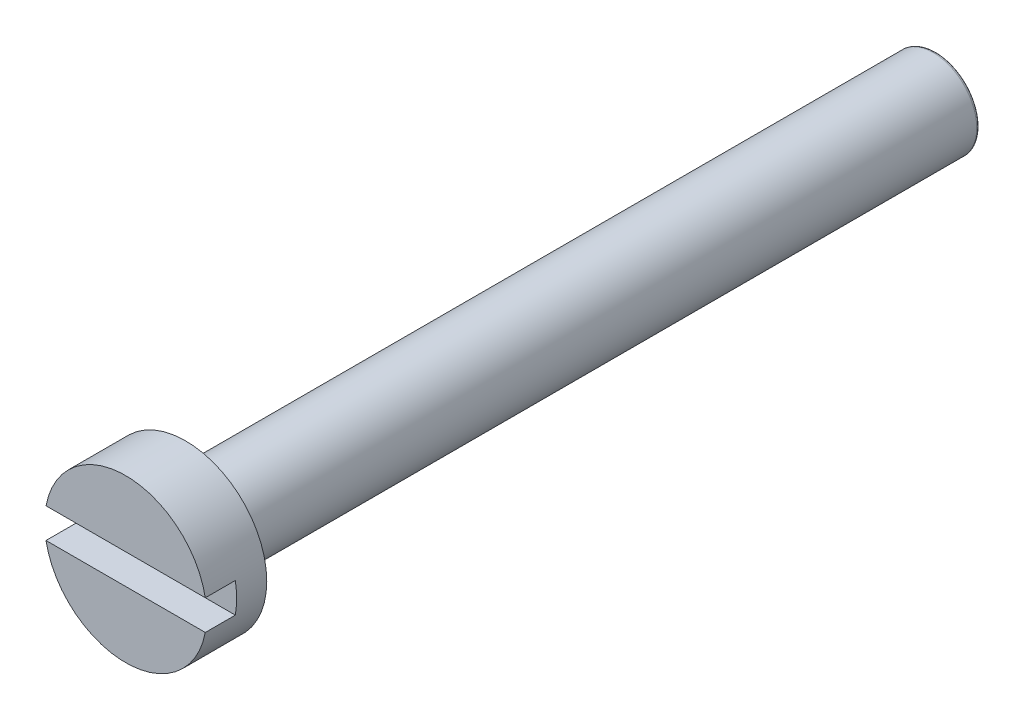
from build123d import *

# Parameters (mm, degrees)
ESQUISSE1_R             = 2.7
EXTRUSION1_DEPTH        = 2
ESQUISSE2_W             = 20
ESQUISSE2_H             = 1
ENL_V_MAT_EXTRU_1_DEPTH = 1
ESQUISSE3_R             = 1.45
EXTRUSION2_DEPTH        = 25
CONG_1_R                = 0.1


with BuildPart() as part:
    # Esquisse1 → Extrusion1 (new body)
    with BuildSketch(Plane.XY):
        Circle(ESQUISSE1_R)
    extrude(amount=EXTRUSION1_DEPTH)

    # Esquisse2 → Enl_v. mat.-Extru.1 (cut)
    with BuildSketch(Plane.XY.offset(2)):
        Rectangle(ESQUISSE2_W, ESQUISSE2_H)
    extrude(amount=-ENL_V_MAT_EXTRU_1_DEPTH, mode=Mode.SUBTRACT)

    # Esquisse3 → Extrusion2 (add)
    with BuildSketch(Plane(origin=(0, 0, 0), x_dir=(-1, 0, 0), z_dir=(0, 0, -1))):
        with Locations(Location((0, 0, 0), (0, 0, 180))):
            Circle(ESQUISSE3_R)
    extrude(amount=EXTRUSION2_DEPTH)

    # Cong_1
    cong_1_edges = [part.edges().sort_by_distance(p)[0] for p in [
        (-1.45, 0, -25),
    ]]
    fillet(cong_1_edges, radius=CONG_1_R)


solid = part.part
